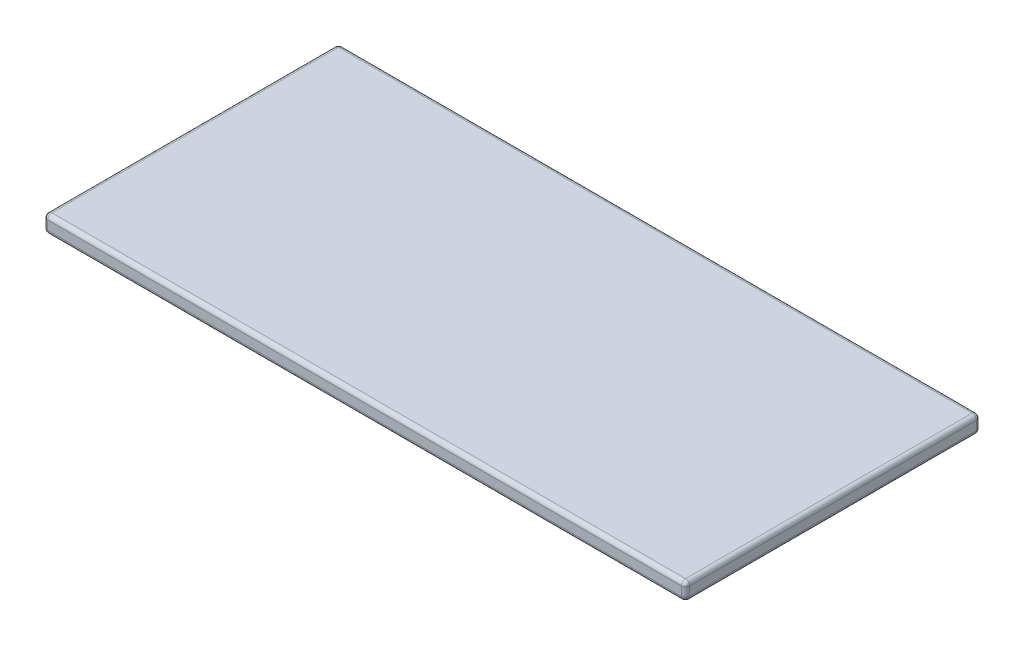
ISO-10303-21;
HEADER;
FILE_DESCRIPTION(('STEP AP214'),'2;1');
FILE_NAME('part.step','',(''),(''),'','','');
FILE_SCHEMA(('AUTOMOTIVE_DESIGN { 1 0 10303 214 1 1 1 1 }'));
ENDSEC;
DATA;
#1=APPLICATION_CONTEXT('core data for automotive mechanical design processes');
#2=APPLICATION_PROTOCOL_DEFINITION('international standard','automotive_design',2000,#1);
#3=PRODUCT_CONTEXT('',#1,'mechanical');
#4=PRODUCT('Part','Part','',(#3));
#5=PRODUCT_RELATED_PRODUCT_CATEGORY('part','',(#4));
#6=PRODUCT_DEFINITION_FORMATION('','',#4);
#7=PRODUCT_DEFINITION_CONTEXT('part definition',#1,'design');
#8=PRODUCT_DEFINITION('design','',#6,#7);
#9=PRODUCT_DEFINITION_SHAPE('','',#8);
#10=(LENGTH_UNIT() NAMED_UNIT(*) SI_UNIT(.MILLI.,.METRE.));
#11=(NAMED_UNIT(*) PLANE_ANGLE_UNIT() SI_UNIT($,.RADIAN.));
#12=(NAMED_UNIT(*) SI_UNIT($,.STERADIAN.) SOLID_ANGLE_UNIT());
#13=UNCERTAINTY_MEASURE_WITH_UNIT(LENGTH_MEASURE(1.E-05),#10,'distance_accuracy_value','');
#14=(GEOMETRIC_REPRESENTATION_CONTEXT(3) GLOBAL_UNCERTAINTY_ASSIGNED_CONTEXT((#13)) GLOBAL_UNIT_ASSIGNED_CONTEXT((#10,
#11,#12)) REPRESENTATION_CONTEXT('',''));
#15=CARTESIAN_POINT('',(0.,0.,0.));
#16=DIRECTION('',(0.,0.,1.));
#17=DIRECTION('',(1.,0.,0.));
#18=AXIS2_PLACEMENT_3D('',#15,#16,#17);
#19=CARTESIAN_POINT('',(-925.,-50.,-425.));
#20=DIRECTION('',(-1.,0.,0.));
#21=DIRECTION('',(0.,0.,1.));
#22=AXIS2_PLACEMENT_3D('',#19,#20,#21);
#23=PLANE('',#22);
#24=DIRECTION('',(0.,0.,1.));
#25=VECTOR('',#24,1.);
#26=CARTESIAN_POINT('',(-925.,-12.,-425.));
#27=LINE('',#26,#25);
#28=CARTESIAN_POINT('',(-925.,-12.,413.));
#29=VERTEX_POINT('',#28);
#30=CARTESIAN_POINT('',(-925.,-12.,-413.));
#31=VERTEX_POINT('',#30);
#32=EDGE_CURVE('E274',#29,#31,#27,.F.);
#33=ORIENTED_EDGE('',*,*,#32,.T.);
#34=DIRECTION('',(0.,1.,0.));
#35=VECTOR('',#34,1.);
#36=CARTESIAN_POINT('',(-925.,-50.,-413.));
#37=LINE('',#36,#35);
#38=CARTESIAN_POINT('',(-925.,-38.,-413.));
#39=VERTEX_POINT('',#38);
#40=EDGE_CURVE('E222',#31,#39,#37,.F.);
#41=ORIENTED_EDGE('',*,*,#40,.T.);
#42=DIRECTION('',(0.,0.,1.));
#43=VECTOR('',#42,1.);
#44=CARTESIAN_POINT('',(-925.,-38.,425.));
#45=LINE('',#44,#43);
#46=CARTESIAN_POINT('',(-925.,-38.,413.));
#47=VERTEX_POINT('',#46);
#48=EDGE_CURVE('E269',#39,#47,#45,.T.);
#49=ORIENTED_EDGE('',*,*,#48,.T.);
#50=DIRECTION('',(0.,1.,0.));
#51=VECTOR('',#50,1.);
#52=CARTESIAN_POINT('',(-925.,-50.,413.));
#53=LINE('',#52,#51);
#54=EDGE_CURVE('E283',#47,#29,#53,.T.);
#55=ORIENTED_EDGE('',*,*,#54,.T.);
#56=EDGE_LOOP('',(#33,#41,#49,#55));
#57=FACE_BOUND('',#56,.T.);
#58=ADVANCED_FACE('F32',(#57),#23,.T.);
#59=CARTESIAN_POINT('',(-925.,-50.,-425.));
#60=DIRECTION('',(0.,0.,-1.));
#61=DIRECTION('',(-1.,0.,0.));
#62=AXIS2_PLACEMENT_3D('',#59,#60,#61);
#63=PLANE('',#62);
#64=DIRECTION('',(-1.,0.,0.));
#65=VECTOR('',#64,1.);
#66=CARTESIAN_POINT('',(-925.,-38.,-425.));
#67=LINE('',#66,#65);
#68=CARTESIAN_POINT('',(913.,-38.,-425.));
#69=VERTEX_POINT('',#68);
#70=CARTESIAN_POINT('',(-913.,-38.,-425.));
#71=VERTEX_POINT('',#70);
#72=EDGE_CURVE('E134',#69,#71,#67,.T.);
#73=ORIENTED_EDGE('',*,*,#72,.T.);
#74=DIRECTION('',(0.,1.,0.));
#75=VECTOR('',#74,1.);
#76=CARTESIAN_POINT('',(-913.,-50.,-425.));
#77=LINE('',#76,#75);
#78=CARTESIAN_POINT('',(-913.,-12.,-425.));
#79=VERTEX_POINT('',#78);
#80=EDGE_CURVE('E130',#71,#79,#77,.T.);
#81=ORIENTED_EDGE('',*,*,#80,.T.);
#82=DIRECTION('',(-1.,0.,0.));
#83=VECTOR('',#82,1.);
#84=CARTESIAN_POINT('',(-925.,-12.,-425.));
#85=LINE('',#84,#83);
#86=CARTESIAN_POINT('',(913.,-12.,-425.));
#87=VERTEX_POINT('',#86);
#88=EDGE_CURVE('E124',#79,#87,#85,.F.);
#89=ORIENTED_EDGE('',*,*,#88,.T.);
#90=DIRECTION('',(0.,1.,0.));
#91=VECTOR('',#90,1.);
#92=CARTESIAN_POINT('',(913.,-50.,-425.));
#93=LINE('',#92,#91);
#94=EDGE_CURVE('E127',#87,#69,#93,.F.);
#95=ORIENTED_EDGE('',*,*,#94,.T.);
#96=EDGE_LOOP('',(#73,#81,#89,#95));
#97=FACE_BOUND('',#96,.T.);
#98=ADVANCED_FACE('F126',(#97),#63,.T.);
#99=CARTESIAN_POINT('',(925.,-50.,-425.));
#100=DIRECTION('',(1.,0.,0.));
#101=DIRECTION('',(0.,0.,-1.));
#102=AXIS2_PLACEMENT_3D('',#99,#100,#101);
#103=PLANE('',#102);
#104=DIRECTION('',(0.,0.,-1.));
#105=VECTOR('',#104,1.);
#106=CARTESIAN_POINT('',(925.,-12.,-425.));
#107=LINE('',#106,#105);
#108=CARTESIAN_POINT('',(925.,-12.,-413.));
#109=VERTEX_POINT('',#108);
#110=CARTESIAN_POINT('',(925.,-12.,413.));
#111=VERTEX_POINT('',#110);
#112=EDGE_CURVE('E41',#109,#111,#107,.F.);
#113=ORIENTED_EDGE('',*,*,#112,.T.);
#114=DIRECTION('',(0.,1.,0.));
#115=VECTOR('',#114,1.);
#116=CARTESIAN_POINT('',(925.,-50.,413.));
#117=LINE('',#116,#115);
#118=CARTESIAN_POINT('',(925.,-38.,413.));
#119=VERTEX_POINT('',#118);
#120=EDGE_CURVE('E11',#111,#119,#117,.F.);
#121=ORIENTED_EDGE('',*,*,#120,.T.);
#122=DIRECTION('',(0.,0.,-1.));
#123=VECTOR('',#122,1.);
#124=CARTESIAN_POINT('',(925.,-38.,-425.));
#125=LINE('',#124,#123);
#126=CARTESIAN_POINT('',(925.,-38.,-413.));
#127=VERTEX_POINT('',#126);
#128=EDGE_CURVE('E245',#119,#127,#125,.T.);
#129=ORIENTED_EDGE('',*,*,#128,.T.);
#130=DIRECTION('',(0.,1.,0.));
#131=VECTOR('',#130,1.);
#132=CARTESIAN_POINT('',(925.,-50.,-413.));
#133=LINE('',#132,#131);
#134=EDGE_CURVE('E243',#127,#109,#133,.T.);
#135=ORIENTED_EDGE('',*,*,#134,.T.);
#136=EDGE_LOOP('',(#113,#121,#129,#135));
#137=FACE_BOUND('',#136,.T.);
#138=ADVANCED_FACE('F301',(#137),#103,.T.);
#139=CARTESIAN_POINT('',(-925.,-50.,425.));
#140=DIRECTION('',(0.,0.,1.));
#141=DIRECTION('',(1.,0.,0.));
#142=AXIS2_PLACEMENT_3D('',#139,#140,#141);
#143=PLANE('',#142);
#144=DIRECTION('',(1.,0.,0.));
#145=VECTOR('',#144,1.);
#146=CARTESIAN_POINT('',(-925.,-12.,425.));
#147=LINE('',#146,#145);
#148=CARTESIAN_POINT('',(913.,-12.,425.));
#149=VERTEX_POINT('',#148);
#150=CARTESIAN_POINT('',(-913.,-12.,425.));
#151=VERTEX_POINT('',#150);
#152=EDGE_CURVE('E238',#149,#151,#147,.F.);
#153=ORIENTED_EDGE('',*,*,#152,.T.);
#154=DIRECTION('',(0.,1.,0.));
#155=VECTOR('',#154,1.);
#156=CARTESIAN_POINT('',(-913.,-50.,425.));
#157=LINE('',#156,#155);
#158=CARTESIAN_POINT('',(-913.,-38.,425.));
#159=VERTEX_POINT('',#158);
#160=EDGE_CURVE('E241',#151,#159,#157,.F.);
#161=ORIENTED_EDGE('',*,*,#160,.T.);
#162=DIRECTION('',(1.,0.,0.));
#163=VECTOR('',#162,1.);
#164=CARTESIAN_POINT('',(925.,-38.,425.));
#165=LINE('',#164,#163);
#166=CARTESIAN_POINT('',(913.,-38.,425.));
#167=VERTEX_POINT('',#166);
#168=EDGE_CURVE('E211',#159,#167,#165,.T.);
#169=ORIENTED_EDGE('',*,*,#168,.T.);
#170=DIRECTION('',(0.,1.,0.));
#171=VECTOR('',#170,1.);
#172=CARTESIAN_POINT('',(913.,-50.,425.));
#173=LINE('',#172,#171);
#174=EDGE_CURVE('E235',#167,#149,#173,.T.);
#175=ORIENTED_EDGE('',*,*,#174,.T.);
#176=EDGE_LOOP('',(#153,#161,#169,#175));
#177=FACE_BOUND('',#176,.T.);
#178=ADVANCED_FACE('F293',(#177),#143,.T.);
#179=CARTESIAN_POINT('',(-925.,-50.,425.));
#180=DIRECTION('',(0.,1.,0.));
#181=DIRECTION('',(0.,0.,1.));
#182=AXIS2_PLACEMENT_3D('',#179,#180,#181);
#183=PLANE('',#182);
#184=DIRECTION('',(1.,0.,0.));
#185=VECTOR('',#184,1.);
#186=CARTESIAN_POINT('',(-925.,-50.,413.));
#187=LINE('',#186,#185);
#188=CARTESIAN_POINT('',(913.,-50.,413.));
#189=VERTEX_POINT('',#188);
#190=CARTESIAN_POINT('',(-913.,-50.,413.));
#191=VERTEX_POINT('',#190);
#192=EDGE_CURVE('E213',#189,#191,#187,.F.);
#193=ORIENTED_EDGE('',*,*,#192,.T.);
#194=DIRECTION('',(0.,0.,1.));
#195=VECTOR('',#194,1.);
#196=CARTESIAN_POINT('',(-913.,-50.,-425.));
#197=LINE('',#196,#195);
#198=CARTESIAN_POINT('',(-913.,-50.,-413.));
#199=VERTEX_POINT('',#198);
#200=EDGE_CURVE('E220',#191,#199,#197,.F.);
#201=ORIENTED_EDGE('',*,*,#200,.T.);
#202=DIRECTION('',(-1.,0.,0.));
#203=VECTOR('',#202,1.);
#204=CARTESIAN_POINT('',(925.,-50.,-413.));
#205=LINE('',#204,#203);
#206=CARTESIAN_POINT('',(913.,-50.,-413.));
#207=VERTEX_POINT('',#206);
#208=EDGE_CURVE('E217',#199,#207,#205,.F.);
#209=ORIENTED_EDGE('',*,*,#208,.T.);
#210=DIRECTION('',(0.,0.,-1.));
#211=VECTOR('',#210,1.);
#212=CARTESIAN_POINT('',(913.,-50.,425.));
#213=LINE('',#212,#211);
#214=EDGE_CURVE('E218',#207,#189,#213,.F.);
#215=ORIENTED_EDGE('',*,*,#214,.T.);
#216=EDGE_LOOP('',(#193,#201,#209,#215));
#217=FACE_BOUND('',#216,.T.);
#218=ADVANCED_FACE('F290',(#217),#183,.F.);
#219=CARTESIAN_POINT('',(-925.,0.,425.));
#220=DIRECTION('',(0.,1.,0.));
#221=DIRECTION('',(0.,0.,1.));
#222=AXIS2_PLACEMENT_3D('',#219,#220,#221);
#223=PLANE('',#222);
#224=DIRECTION('',(-1.,0.,0.));
#225=VECTOR('',#224,1.);
#226=CARTESIAN_POINT('',(-925.,0.,-413.));
#227=LINE('',#226,#225);
#228=CARTESIAN_POINT('',(913.,0.,-413.));
#229=VERTEX_POINT('',#228);
#230=CARTESIAN_POINT('',(-913.,0.,-413.));
#231=VERTEX_POINT('',#230);
#232=EDGE_CURVE('E156',#229,#231,#227,.T.);
#233=ORIENTED_EDGE('',*,*,#232,.T.);
#234=DIRECTION('',(0.,0.,1.));
#235=VECTOR('',#234,1.);
#236=CARTESIAN_POINT('',(-913.,0.,425.));
#237=LINE('',#236,#235);
#238=CARTESIAN_POINT('',(-913.,0.,413.));
#239=VERTEX_POINT('',#238);
#240=EDGE_CURVE('E232',#231,#239,#237,.T.);
#241=ORIENTED_EDGE('',*,*,#240,.T.);
#242=DIRECTION('',(1.,0.,0.));
#243=VECTOR('',#242,1.);
#244=CARTESIAN_POINT('',(-925.,0.,413.));
#245=LINE('',#244,#243);
#246=CARTESIAN_POINT('',(913.,0.,413.));
#247=VERTEX_POINT('',#246);
#248=EDGE_CURVE('E230',#239,#247,#245,.T.);
#249=ORIENTED_EDGE('',*,*,#248,.T.);
#250=DIRECTION('',(0.,0.,-1.));
#251=VECTOR('',#250,1.);
#252=CARTESIAN_POINT('',(913.,0.,425.));
#253=LINE('',#252,#251);
#254=EDGE_CURVE('E228',#247,#229,#253,.T.);
#255=ORIENTED_EDGE('',*,*,#254,.T.);
#256=EDGE_LOOP('',(#233,#241,#249,#255));
#257=FACE_BOUND('',#256,.T.);
#258=ADVANCED_FACE('F292',(#257),#223,.T.);
#259=CARTESIAN_POINT('',(913.,-50.,413.));
#260=DIRECTION('',(0.,1.,0.));
#261=DIRECTION('',(0.,0.,1.));
#262=AXIS2_PLACEMENT_3D('',#259,#260,#261);
#263=CYLINDRICAL_SURFACE('',#262,12.);
#264=CARTESIAN_POINT('',(913.,-38.,413.));
#265=DIRECTION('',(0.,-1.,0.));
#266=DIRECTION('',(0.,0.,-1.));
#267=AXIS2_PLACEMENT_3D('',#264,#265,#266);
#268=CIRCLE('',#267,12.);
#269=EDGE_CURVE('E36',#119,#167,#268,.T.);
#270=ORIENTED_EDGE('',*,*,#269,.F.);
#271=ORIENTED_EDGE('',*,*,#120,.F.);
#272=CARTESIAN_POINT('',(913.,-12.,413.));
#273=DIRECTION('',(0.,1.,0.));
#274=DIRECTION('',(0.,0.,1.));
#275=AXIS2_PLACEMENT_3D('',#272,#273,#274);
#276=CIRCLE('',#275,12.);
#277=EDGE_CURVE('E194',#149,#111,#276,.T.);
#278=ORIENTED_EDGE('',*,*,#277,.F.);
#279=ORIENTED_EDGE('',*,*,#174,.F.);
#280=EDGE_LOOP('',(#270,#271,#278,#279));
#281=FACE_BOUND('',#280,.T.);
#282=ADVANCED_FACE('F34',(#281),#263,.T.);
#283=CARTESIAN_POINT('',(913.,-38.,413.));
#284=DIRECTION('',(0.,0.,1.));
#285=DIRECTION('',(1.,0.,0.));
#286=AXIS2_PLACEMENT_3D('',#283,#284,#285);
#287=SPHERICAL_SURFACE('',#286,12.);
#288=CARTESIAN_POINT('',(913.,-38.,413.));
#289=DIRECTION('',(0.,0.,1.));
#290=DIRECTION('',(1.,0.,0.));
#291=AXIS2_PLACEMENT_3D('',#288,#289,#290);
#292=CIRCLE('',#291,12.);
#293=EDGE_CURVE('E189',#119,#189,#292,.F.);
#294=ORIENTED_EDGE('',*,*,#293,.F.);
#295=ORIENTED_EDGE('',*,*,#269,.T.);
#296=CARTESIAN_POINT('',(913.,-38.,413.));
#297=DIRECTION('',(1.,0.,0.));
#298=DIRECTION('',(0.,1.,0.));
#299=AXIS2_PLACEMENT_3D('',#296,#297,#298);
#300=CIRCLE('',#299,12.);
#301=EDGE_CURVE('E192',#189,#167,#300,.F.);
#302=ORIENTED_EDGE('',*,*,#301,.F.);
#303=EDGE_LOOP('',(#294,#295,#302));
#304=FACE_BOUND('',#303,.T.);
#305=ADVANCED_FACE('F202',(#304),#287,.T.);
#306=CARTESIAN_POINT('',(913.,-12.,413.));
#307=DIRECTION('',(0.,0.,1.));
#308=DIRECTION('',(1.,0.,0.));
#309=AXIS2_PLACEMENT_3D('',#306,#307,#308);
#310=SPHERICAL_SURFACE('',#309,12.);
#311=CARTESIAN_POINT('',(913.,-12.,413.));
#312=DIRECTION('',(1.,0.,0.));
#313=DIRECTION('',(0.,0.,-1.));
#314=AXIS2_PLACEMENT_3D('',#311,#312,#313);
#315=CIRCLE('',#314,12.);
#316=EDGE_CURVE('E185',#149,#247,#315,.F.);
#317=ORIENTED_EDGE('',*,*,#316,.F.);
#318=ORIENTED_EDGE('',*,*,#277,.T.);
#319=CARTESIAN_POINT('',(913.,-12.,413.));
#320=DIRECTION('',(0.,0.,1.));
#321=DIRECTION('',(1.,0.,0.));
#322=AXIS2_PLACEMENT_3D('',#319,#320,#321);
#323=CIRCLE('',#322,12.);
#324=EDGE_CURVE('E49',#247,#111,#323,.F.);
#325=ORIENTED_EDGE('',*,*,#324,.F.);
#326=EDGE_LOOP('',(#317,#318,#325));
#327=FACE_BOUND('',#326,.T.);
#328=ADVANCED_FACE('F364',(#327),#310,.T.);
#329=CARTESIAN_POINT('',(-925.,-38.,413.));
#330=DIRECTION('',(-1.,0.,0.));
#331=DIRECTION('',(0.,0.,1.));
#332=AXIS2_PLACEMENT_3D('',#329,#330,#331);
#333=CYLINDRICAL_SURFACE('',#332,12.);
#334=ORIENTED_EDGE('',*,*,#301,.T.);
#335=ORIENTED_EDGE('',*,*,#168,.F.);
#336=CARTESIAN_POINT('',(-913.,-38.,413.));
#337=DIRECTION('',(-1.,0.,0.));
#338=DIRECTION('',(0.,0.,1.));
#339=AXIS2_PLACEMENT_3D('',#336,#337,#338);
#340=CIRCLE('',#339,12.);
#341=EDGE_CURVE('E179',#191,#159,#340,.T.);
#342=ORIENTED_EDGE('',*,*,#341,.F.);
#343=ORIENTED_EDGE('',*,*,#192,.F.);
#344=EDGE_LOOP('',(#334,#335,#342,#343));
#345=FACE_BOUND('',#344,.T.);
#346=ADVANCED_FACE('F209',(#345),#333,.T.);
#347=CARTESIAN_POINT('',(913.,-38.,-425.));
#348=DIRECTION('',(0.,0.,1.));
#349=DIRECTION('',(1.,0.,0.));
#350=AXIS2_PLACEMENT_3D('',#347,#348,#349);
#351=CYLINDRICAL_SURFACE('',#350,12.);
#352=ORIENTED_EDGE('',*,*,#293,.T.);
#353=ORIENTED_EDGE('',*,*,#214,.F.);
#354=CARTESIAN_POINT('',(913.,-38.,-413.));
#355=DIRECTION('',(0.,0.,-1.));
#356=DIRECTION('',(-1.,0.,0.));
#357=AXIS2_PLACEMENT_3D('',#354,#355,#356);
#358=CIRCLE('',#357,12.);
#359=EDGE_CURVE('E176',#127,#207,#358,.T.);
#360=ORIENTED_EDGE('',*,*,#359,.F.);
#361=ORIENTED_EDGE('',*,*,#128,.F.);
#362=EDGE_LOOP('',(#352,#353,#360,#361));
#363=FACE_BOUND('',#362,.T.);
#364=ADVANCED_FACE('F358',(#363),#351,.T.);
#365=CARTESIAN_POINT('',(913.,-50.,-413.));
#366=DIRECTION('',(0.,1.,0.));
#367=DIRECTION('',(0.,0.,1.));
#368=AXIS2_PLACEMENT_3D('',#365,#366,#367);
#369=CYLINDRICAL_SURFACE('',#368,12.);
#370=CARTESIAN_POINT('',(913.,-12.,-413.));
#371=DIRECTION('',(0.,1.,0.));
#372=DIRECTION('',(0.,0.,1.));
#373=AXIS2_PLACEMENT_3D('',#370,#371,#372);
#374=CIRCLE('',#373,12.);
#375=EDGE_CURVE('E141',#109,#87,#374,.T.);
#376=ORIENTED_EDGE('',*,*,#375,.F.);
#377=ORIENTED_EDGE('',*,*,#134,.F.);
#378=CARTESIAN_POINT('',(913.,-38.,-413.));
#379=DIRECTION('',(0.,-1.,0.));
#380=DIRECTION('',(0.,0.,-1.));
#381=AXIS2_PLACEMENT_3D('',#378,#379,#380);
#382=CIRCLE('',#381,12.);
#383=EDGE_CURVE('E144',#69,#127,#382,.T.);
#384=ORIENTED_EDGE('',*,*,#383,.F.);
#385=ORIENTED_EDGE('',*,*,#94,.F.);
#386=EDGE_LOOP('',(#376,#377,#384,#385));
#387=FACE_BOUND('',#386,.T.);
#388=ADVANCED_FACE('F139',(#387),#369,.T.);
#389=CARTESIAN_POINT('',(913.,-12.,425.));
#390=DIRECTION('',(0.,0.,-1.));
#391=DIRECTION('',(-1.,0.,0.));
#392=AXIS2_PLACEMENT_3D('',#389,#390,#391);
#393=CYLINDRICAL_SURFACE('',#392,12.);
#394=ORIENTED_EDGE('',*,*,#324,.T.);
#395=ORIENTED_EDGE('',*,*,#112,.F.);
#396=CARTESIAN_POINT('',(913.,-12.,-413.));
#397=DIRECTION('',(0.,0.,-1.));
#398=DIRECTION('',(-1.,0.,0.));
#399=AXIS2_PLACEMENT_3D('',#396,#397,#398);
#400=CIRCLE('',#399,12.);
#401=EDGE_CURVE('E153',#229,#109,#400,.T.);
#402=ORIENTED_EDGE('',*,*,#401,.F.);
#403=ORIENTED_EDGE('',*,*,#254,.F.);
#404=EDGE_LOOP('',(#394,#395,#402,#403));
#405=FACE_BOUND('',#404,.T.);
#406=ADVANCED_FACE('F352',(#405),#393,.T.);
#407=CARTESIAN_POINT('',(-925.,-12.,413.));
#408=DIRECTION('',(1.,0.,0.));
#409=DIRECTION('',(0.,0.,-1.));
#410=AXIS2_PLACEMENT_3D('',#407,#408,#409);
#411=CYLINDRICAL_SURFACE('',#410,12.);
#412=ORIENTED_EDGE('',*,*,#316,.T.);
#413=ORIENTED_EDGE('',*,*,#248,.F.);
#414=CARTESIAN_POINT('',(-913.,-12.,413.));
#415=DIRECTION('',(-1.,0.,0.));
#416=DIRECTION('',(0.,0.,1.));
#417=AXIS2_PLACEMENT_3D('',#414,#415,#416);
#418=CIRCLE('',#417,12.);
#419=EDGE_CURVE('E171',#151,#239,#418,.T.);
#420=ORIENTED_EDGE('',*,*,#419,.F.);
#421=ORIENTED_EDGE('',*,*,#152,.F.);
#422=EDGE_LOOP('',(#412,#413,#420,#421));
#423=FACE_BOUND('',#422,.T.);
#424=ADVANCED_FACE('F348',(#423),#411,.T.);
#425=CARTESIAN_POINT('',(-913.,-50.,413.));
#426=DIRECTION('',(0.,1.,0.));
#427=DIRECTION('',(0.,0.,1.));
#428=AXIS2_PLACEMENT_3D('',#425,#426,#427);
#429=CYLINDRICAL_SURFACE('',#428,12.);
#430=CARTESIAN_POINT('',(-913.,-38.,413.));
#431=DIRECTION('',(0.,-1.,0.));
#432=DIRECTION('',(0.,0.,-1.));
#433=AXIS2_PLACEMENT_3D('',#430,#431,#432);
#434=CIRCLE('',#433,12.);
#435=EDGE_CURVE('E182',#159,#47,#434,.T.);
#436=ORIENTED_EDGE('',*,*,#435,.F.);
#437=ORIENTED_EDGE('',*,*,#160,.F.);
#438=CARTESIAN_POINT('',(-913.,-12.,413.));
#439=DIRECTION('',(0.,1.,0.));
#440=DIRECTION('',(0.,0.,1.));
#441=AXIS2_PLACEMENT_3D('',#438,#439,#440);
#442=CIRCLE('',#441,12.);
#443=EDGE_CURVE('E169',#29,#151,#442,.T.);
#444=ORIENTED_EDGE('',*,*,#443,.F.);
#445=ORIENTED_EDGE('',*,*,#54,.F.);
#446=EDGE_LOOP('',(#436,#437,#444,#445));
#447=FACE_BOUND('',#446,.T.);
#448=ADVANCED_FACE('F344',(#447),#429,.T.);
#449=CARTESIAN_POINT('',(-913.,-38.,413.));
#450=DIRECTION('',(0.,0.,1.));
#451=DIRECTION('',(1.,0.,0.));
#452=AXIS2_PLACEMENT_3D('',#449,#450,#451);
#453=SPHERICAL_SURFACE('',#452,12.);
#454=ORIENTED_EDGE('',*,*,#341,.T.);
#455=ORIENTED_EDGE('',*,*,#435,.T.);
#456=CARTESIAN_POINT('',(-913.,-38.,413.));
#457=DIRECTION('',(0.,0.,1.));
#458=DIRECTION('',(1.,0.,0.));
#459=AXIS2_PLACEMENT_3D('',#456,#457,#458);
#460=CIRCLE('',#459,12.);
#461=EDGE_CURVE('E161',#191,#47,#460,.F.);
#462=ORIENTED_EDGE('',*,*,#461,.F.);
#463=EDGE_LOOP('',(#454,#455,#462));
#464=FACE_BOUND('',#463,.T.);
#465=ADVANCED_FACE('F340',(#464),#453,.T.);
#466=CARTESIAN_POINT('',(913.,-38.,-413.));
#467=DIRECTION('',(0.,0.,1.));
#468=DIRECTION('',(1.,0.,0.));
#469=AXIS2_PLACEMENT_3D('',#466,#467,#468);
#470=SPHERICAL_SURFACE('',#469,12.);
#471=ORIENTED_EDGE('',*,*,#383,.T.);
#472=ORIENTED_EDGE('',*,*,#359,.T.);
#473=CARTESIAN_POINT('',(913.,-38.,-413.));
#474=DIRECTION('',(1.,0.,0.));
#475=DIRECTION('',(0.,0.,-1.));
#476=AXIS2_PLACEMENT_3D('',#473,#474,#475);
#477=CIRCLE('',#476,12.);
#478=EDGE_CURVE('E157',#69,#207,#477,.F.);
#479=ORIENTED_EDGE('',*,*,#478,.F.);
#480=EDGE_LOOP('',(#471,#472,#479));
#481=FACE_BOUND('',#480,.T.);
#482=ADVANCED_FACE('F337',(#481),#470,.T.);
#483=CARTESIAN_POINT('',(913.,-12.,-413.));
#484=DIRECTION('',(0.,0.,1.));
#485=DIRECTION('',(1.,0.,0.));
#486=AXIS2_PLACEMENT_3D('',#483,#484,#485);
#487=SPHERICAL_SURFACE('',#486,12.);
#488=ORIENTED_EDGE('',*,*,#401,.T.);
#489=ORIENTED_EDGE('',*,*,#375,.T.);
#490=CARTESIAN_POINT('',(913.,-12.,-413.));
#491=DIRECTION('',(1.,0.,0.));
#492=DIRECTION('',(0.,1.,0.));
#493=AXIS2_PLACEMENT_3D('',#490,#491,#492);
#494=CIRCLE('',#493,12.);
#495=EDGE_CURVE('E150',#229,#87,#494,.F.);
#496=ORIENTED_EDGE('',*,*,#495,.F.);
#497=EDGE_LOOP('',(#488,#489,#496));
#498=FACE_BOUND('',#497,.T.);
#499=ADVANCED_FACE('F149',(#498),#487,.T.);
#500=CARTESIAN_POINT('',(-913.,-12.,413.));
#501=DIRECTION('',(0.,0.,1.));
#502=DIRECTION('',(1.,0.,0.));
#503=AXIS2_PLACEMENT_3D('',#500,#501,#502);
#504=SPHERICAL_SURFACE('',#503,12.);
#505=ORIENTED_EDGE('',*,*,#443,.T.);
#506=ORIENTED_EDGE('',*,*,#419,.T.);
#507=CARTESIAN_POINT('',(-913.,-12.,413.));
#508=DIRECTION('',(0.,0.,1.));
#509=DIRECTION('',(1.,0.,0.));
#510=AXIS2_PLACEMENT_3D('',#507,#508,#509);
#511=CIRCLE('',#510,12.);
#512=EDGE_CURVE('E158',#29,#239,#511,.F.);
#513=ORIENTED_EDGE('',*,*,#512,.F.);
#514=EDGE_LOOP('',(#505,#506,#513));
#515=FACE_BOUND('',#514,.T.);
#516=ADVANCED_FACE('F331',(#515),#504,.T.);
#517=CARTESIAN_POINT('',(-913.,-38.,-425.));
#518=DIRECTION('',(0.,0.,-1.));
#519=DIRECTION('',(-1.,0.,0.));
#520=AXIS2_PLACEMENT_3D('',#517,#518,#519);
#521=CYLINDRICAL_SURFACE('',#520,12.);
#522=ORIENTED_EDGE('',*,*,#461,.T.);
#523=ORIENTED_EDGE('',*,*,#48,.F.);
#524=CARTESIAN_POINT('',(-913.,-38.,-413.));
#525=DIRECTION('',(0.,0.,-1.));
#526=DIRECTION('',(-1.,0.,0.));
#527=AXIS2_PLACEMENT_3D('',#524,#525,#526);
#528=CIRCLE('',#527,12.);
#529=EDGE_CURVE('E163',#199,#39,#528,.T.);
#530=ORIENTED_EDGE('',*,*,#529,.F.);
#531=ORIENTED_EDGE('',*,*,#200,.F.);
#532=EDGE_LOOP('',(#522,#523,#530,#531));
#533=FACE_BOUND('',#532,.T.);
#534=ADVANCED_FACE('F271',(#533),#521,.T.);
#535=CARTESIAN_POINT('',(-925.,-38.,-413.));
#536=DIRECTION('',(1.,0.,0.));
#537=DIRECTION('',(0.,0.,-1.));
#538=AXIS2_PLACEMENT_3D('',#535,#536,#537);
#539=CYLINDRICAL_SURFACE('',#538,12.);
#540=ORIENTED_EDGE('',*,*,#478,.T.);
#541=ORIENTED_EDGE('',*,*,#208,.F.);
#542=CARTESIAN_POINT('',(-913.,-38.,-413.));
#543=DIRECTION('',(-1.,0.,0.));
#544=DIRECTION('',(0.,0.,1.));
#545=AXIS2_PLACEMENT_3D('',#542,#543,#544);
#546=CIRCLE('',#545,12.);
#547=EDGE_CURVE('E258',#71,#199,#546,.T.);
#548=ORIENTED_EDGE('',*,*,#547,.F.);
#549=ORIENTED_EDGE('',*,*,#72,.F.);
#550=EDGE_LOOP('',(#540,#541,#548,#549));
#551=FACE_BOUND('',#550,.T.);
#552=ADVANCED_FACE('F288',(#551),#539,.T.);
#553=CARTESIAN_POINT('',(-925.,-12.,-413.));
#554=DIRECTION('',(-1.,0.,0.));
#555=DIRECTION('',(0.,0.,1.));
#556=AXIS2_PLACEMENT_3D('',#553,#554,#555);
#557=CYLINDRICAL_SURFACE('',#556,12.);
#558=ORIENTED_EDGE('',*,*,#495,.T.);
#559=ORIENTED_EDGE('',*,*,#88,.F.);
#560=CARTESIAN_POINT('',(-913.,-12.,-413.));
#561=DIRECTION('',(-1.,0.,0.));
#562=DIRECTION('',(0.,0.,1.));
#563=AXIS2_PLACEMENT_3D('',#560,#561,#562);
#564=CIRCLE('',#563,12.);
#565=EDGE_CURVE('E255',#231,#79,#564,.T.);
#566=ORIENTED_EDGE('',*,*,#565,.F.);
#567=ORIENTED_EDGE('',*,*,#232,.F.);
#568=EDGE_LOOP('',(#558,#559,#566,#567));
#569=FACE_BOUND('',#568,.T.);
#570=ADVANCED_FACE('F155',(#569),#557,.T.);
#571=CARTESIAN_POINT('',(-913.,-12.,425.));
#572=DIRECTION('',(0.,0.,1.));
#573=DIRECTION('',(1.,0.,0.));
#574=AXIS2_PLACEMENT_3D('',#571,#572,#573);
#575=CYLINDRICAL_SURFACE('',#574,12.);
#576=ORIENTED_EDGE('',*,*,#512,.T.);
#577=ORIENTED_EDGE('',*,*,#240,.F.);
#578=CARTESIAN_POINT('',(-913.,-12.,-413.));
#579=DIRECTION('',(0.,0.,-1.));
#580=DIRECTION('',(-1.,0.,0.));
#581=AXIS2_PLACEMENT_3D('',#578,#579,#580);
#582=CIRCLE('',#581,12.);
#583=EDGE_CURVE('E252',#31,#231,#582,.T.);
#584=ORIENTED_EDGE('',*,*,#583,.F.);
#585=ORIENTED_EDGE('',*,*,#32,.F.);
#586=EDGE_LOOP('',(#576,#577,#584,#585));
#587=FACE_BOUND('',#586,.T.);
#588=ADVANCED_FACE('F321',(#587),#575,.T.);
#589=CARTESIAN_POINT('',(-913.,-38.,-413.));
#590=DIRECTION('',(0.,0.,1.));
#591=DIRECTION('',(1.,0.,0.));
#592=AXIS2_PLACEMENT_3D('',#589,#590,#591);
#593=SPHERICAL_SURFACE('',#592,12.);
#594=ORIENTED_EDGE('',*,*,#547,.T.);
#595=ORIENTED_EDGE('',*,*,#529,.T.);
#596=CARTESIAN_POINT('',(-913.,-38.,-413.));
#597=DIRECTION('',(0.,-1.,0.));
#598=DIRECTION('',(0.,0.,-1.));
#599=AXIS2_PLACEMENT_3D('',#596,#597,#598);
#600=CIRCLE('',#599,12.);
#601=EDGE_CURVE('E250',#71,#39,#600,.F.);
#602=ORIENTED_EDGE('',*,*,#601,.F.);
#603=EDGE_LOOP('',(#594,#595,#602));
#604=FACE_BOUND('',#603,.T.);
#605=ADVANCED_FACE('F264',(#604),#593,.T.);
#606=CARTESIAN_POINT('',(-913.,-12.,-413.));
#607=DIRECTION('',(0.,0.,1.));
#608=DIRECTION('',(1.,0.,0.));
#609=AXIS2_PLACEMENT_3D('',#606,#607,#608);
#610=SPHERICAL_SURFACE('',#609,12.);
#611=ORIENTED_EDGE('',*,*,#583,.T.);
#612=ORIENTED_EDGE('',*,*,#565,.T.);
#613=CARTESIAN_POINT('',(-913.,-12.,-413.));
#614=DIRECTION('',(0.,1.,0.));
#615=DIRECTION('',(0.,0.,1.));
#616=AXIS2_PLACEMENT_3D('',#613,#614,#615);
#617=CIRCLE('',#616,12.);
#618=EDGE_CURVE('E248',#31,#79,#617,.F.);
#619=ORIENTED_EDGE('',*,*,#618,.F.);
#620=EDGE_LOOP('',(#611,#612,#619));
#621=FACE_BOUND('',#620,.T.);
#622=ADVANCED_FACE('F315',(#621),#610,.T.);
#623=CARTESIAN_POINT('',(-913.,-50.,-413.));
#624=DIRECTION('',(0.,1.,0.));
#625=DIRECTION('',(0.,0.,1.));
#626=AXIS2_PLACEMENT_3D('',#623,#624,#625);
#627=CYLINDRICAL_SURFACE('',#626,12.);
#628=ORIENTED_EDGE('',*,*,#601,.T.);
#629=ORIENTED_EDGE('',*,*,#40,.F.);
#630=ORIENTED_EDGE('',*,*,#618,.T.);
#631=ORIENTED_EDGE('',*,*,#80,.F.);
#632=EDGE_LOOP('',(#628,#629,#630,#631));
#633=FACE_BOUND('',#632,.T.);
#634=ADVANCED_FACE('F312',(#633),#627,.T.);
#635=CLOSED_SHELL('',(#58,#98,#138,#178,#218,#258,#282,#305,#328,#346,#364,#388,#406,#424,#448,
#465,#482,#499,#516,#534,#552,#570,#588,#605,#622,#634));
#636=MANIFOLD_SOLID_BREP('B2',#635);
#637=ADVANCED_BREP_SHAPE_REPRESENTATION('',(#18,#636),#14);
#638=SHAPE_DEFINITION_REPRESENTATION(#9,#637);
ENDSEC;
END-ISO-10303-21;
